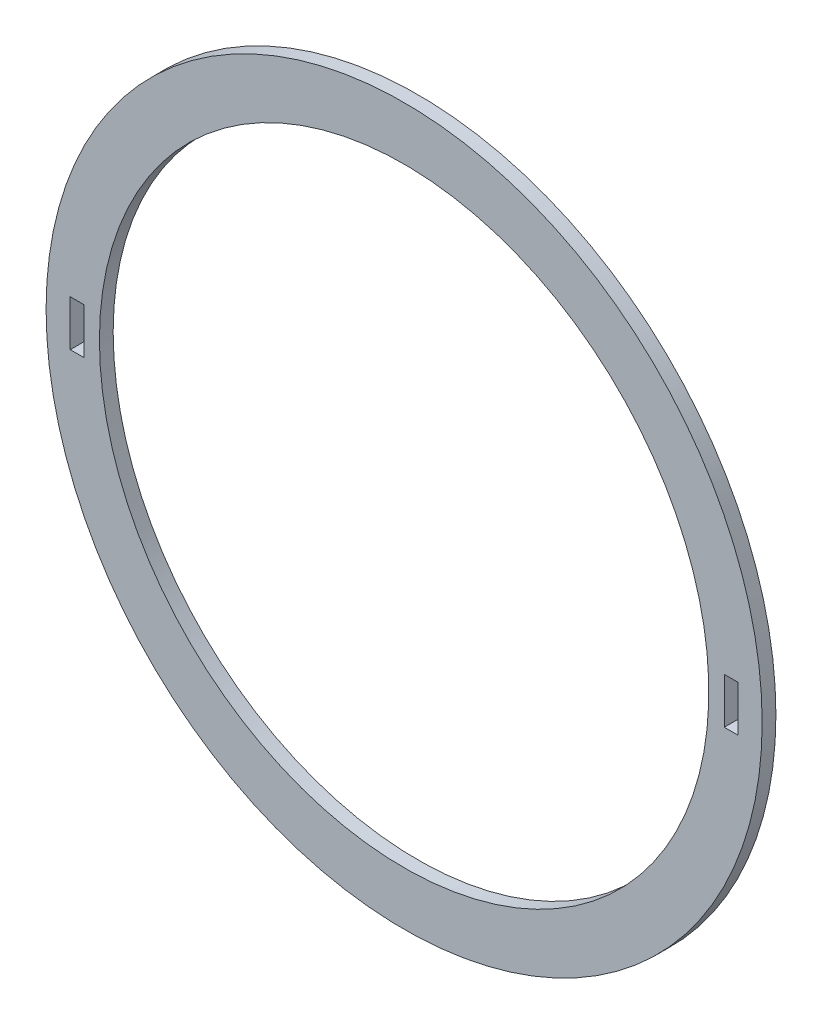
from build123d import *

# Parameters (mm, degrees)
SKETCH1_R           = 39.6875
SKETCH1_R_2         = 33.776867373
SKETCH1_W           = 1.524
SKETCH1_H           = 5.08
BOSS_EXTRUDE1_DEPTH = 1.524


with BuildPart() as part:
    # Sketch1 → Boss-Extrude1 (new body)
    with BuildSketch(Plane.XY):
        with Locations(Location((0, 25.14119341, 0), (0, 0, 180))):
            Circle(SKETCH1_R)
        with Locations(Location((0, 25.14119341, 0), (0, 0, 180))):
            Circle(SKETCH1_R_2, mode=Mode.SUBTRACT)
        with Locations((36.247543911, 25.14119341)):
            Rectangle(SKETCH1_W, SKETCH1_H, mode=Mode.SUBTRACT)
        with Locations((-36.247543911, 25.14119341)):
            Rectangle(SKETCH1_W, SKETCH1_H, mode=Mode.SUBTRACT)
    extrude(amount=BOSS_EXTRUDE1_DEPTH)


solid = part.part
